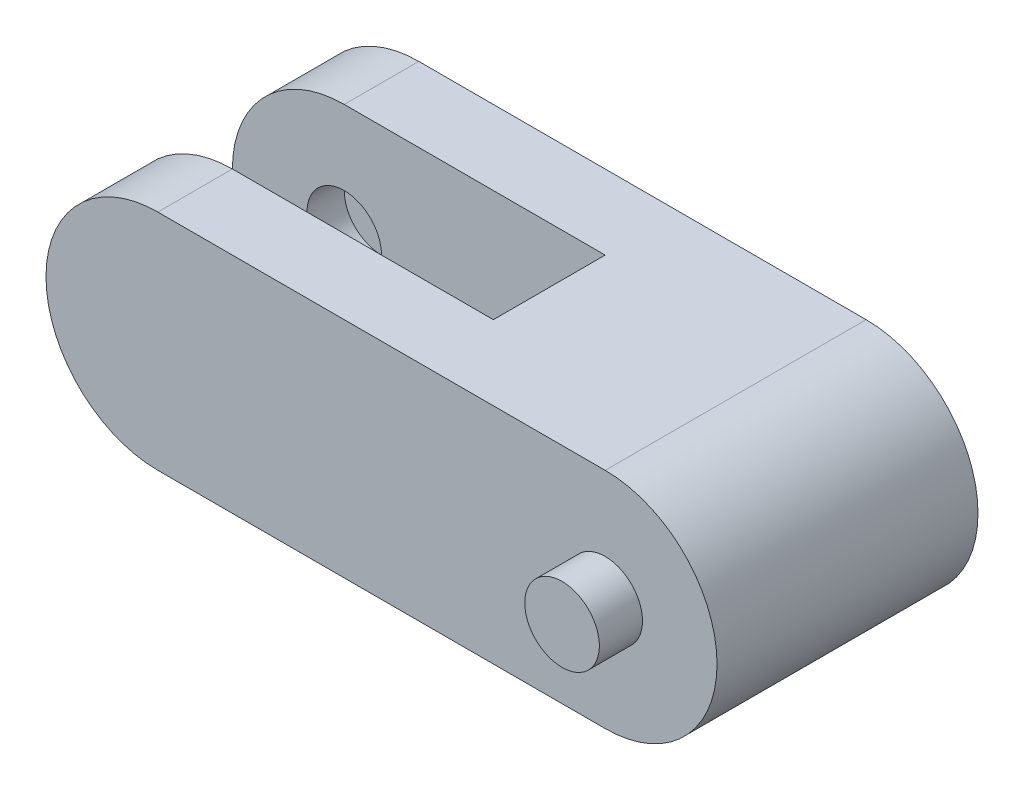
ISO-10303-21;
HEADER;
FILE_DESCRIPTION(('STEP AP214'),'2;1');
FILE_NAME('part.step','',(''),(''),'','','');
FILE_SCHEMA(('AUTOMOTIVE_DESIGN { 1 0 10303 214 1 1 1 1 }'));
ENDSEC;
DATA;
#1=APPLICATION_CONTEXT('core data for automotive mechanical design processes');
#2=APPLICATION_PROTOCOL_DEFINITION('international standard','automotive_design',2000,#1);
#3=PRODUCT_CONTEXT('',#1,'mechanical');
#4=PRODUCT('Part','Part','',(#3));
#5=PRODUCT_RELATED_PRODUCT_CATEGORY('part','',(#4));
#6=PRODUCT_DEFINITION_FORMATION('','',#4);
#7=PRODUCT_DEFINITION_CONTEXT('part definition',#1,'design');
#8=PRODUCT_DEFINITION('design','',#6,#7);
#9=PRODUCT_DEFINITION_SHAPE('','',#8);
#10=(LENGTH_UNIT() NAMED_UNIT(*) SI_UNIT(.MILLI.,.METRE.));
#11=(NAMED_UNIT(*) PLANE_ANGLE_UNIT() SI_UNIT($,.RADIAN.));
#12=(NAMED_UNIT(*) SI_UNIT($,.STERADIAN.) SOLID_ANGLE_UNIT());
#13=UNCERTAINTY_MEASURE_WITH_UNIT(LENGTH_MEASURE(1.E-05),#10,'distance_accuracy_value','');
#14=(GEOMETRIC_REPRESENTATION_CONTEXT(3) GLOBAL_UNCERTAINTY_ASSIGNED_CONTEXT((#13)) GLOBAL_UNIT_ASSIGNED_CONTEXT((#10,
#11,#12)) REPRESENTATION_CONTEXT('',''));
#15=CARTESIAN_POINT('',(0.,0.,0.));
#16=DIRECTION('',(0.,0.,1.));
#17=DIRECTION('',(1.,0.,0.));
#18=AXIS2_PLACEMENT_3D('',#15,#16,#17);
#19=CARTESIAN_POINT('',(-76.2,0.,44.45));
#20=DIRECTION('',(0.,0.,-1.));
#21=DIRECTION('',(-1.,0.,0.));
#22=AXIS2_PLACEMENT_3D('',#19,#20,#21);
#23=CYLINDRICAL_SURFACE('',#22,38.1);
#24=CARTESIAN_POINT('',(-76.1999999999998,0.,-19.05));
#25=DIRECTION('',(0.,0.,1.));
#26=DIRECTION('',(1.,0.,0.));
#27=AXIS2_PLACEMENT_3D('',#24,#25,#26);
#28=CIRCLE('',#27,38.1);
#29=CARTESIAN_POINT('',(-76.2,38.1,-19.05));
#30=VERTEX_POINT('',#29);
#31=CARTESIAN_POINT('',(-76.1999999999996,-38.1,-19.05));
#32=VERTEX_POINT('',#31);
#33=EDGE_CURVE('E117',#30,#32,#28,.T.);
#34=ORIENTED_EDGE('',*,*,#33,.F.);
#35=DIRECTION('',(0.,0.,-1.));
#36=VECTOR('',#35,1.);
#37=CARTESIAN_POINT('',(-76.2,38.1,44.45));
#38=LINE('',#37,#36);
#39=CARTESIAN_POINT('',(-76.2,38.1,-44.45));
#40=VERTEX_POINT('',#39);
#41=EDGE_CURVE('E87',#30,#40,#38,.T.);
#42=ORIENTED_EDGE('',*,*,#41,.T.);
#43=CARTESIAN_POINT('',(-76.2,0.,-44.45));
#44=DIRECTION('',(0.,0.,1.));
#45=DIRECTION('',(1.,0.,0.));
#46=AXIS2_PLACEMENT_3D('',#43,#44,#45);
#47=CIRCLE('',#46,38.1);
#48=CARTESIAN_POINT('',(-76.2,-38.1,-44.45));
#49=VERTEX_POINT('',#48);
#50=EDGE_CURVE('E136',#40,#49,#47,.T.);
#51=ORIENTED_EDGE('',*,*,#50,.T.);
#52=DIRECTION('',(0.,0.,-1.));
#53=VECTOR('',#52,1.);
#54=CARTESIAN_POINT('',(-76.2,-38.1,44.45));
#55=LINE('',#54,#53);
#56=EDGE_CURVE('E129',#32,#49,#55,.T.);
#57=ORIENTED_EDGE('',*,*,#56,.F.);
#58=EDGE_LOOP('',(#34,#42,#51,#57));
#59=FACE_BOUND('',#58,.T.);
#60=ADVANCED_FACE('F41',(#59),#23,.T.);
#61=CARTESIAN_POINT('',(-76.2,-38.1,44.45));
#62=DIRECTION('',(0.,1.,0.));
#63=DIRECTION('',(0.,0.,1.));
#64=AXIS2_PLACEMENT_3D('',#61,#62,#63);
#65=PLANE('',#64);
#66=DIRECTION('',(1.,0.,0.));
#67=VECTOR('',#66,1.);
#68=CARTESIAN_POINT('',(12.7,-38.1,-19.05));
#69=LINE('',#68,#67);
#70=CARTESIAN_POINT('',(12.7,-38.1,-19.05));
#71=VERTEX_POINT('',#70);
#72=EDGE_CURVE('E121',#32,#71,#69,.T.);
#73=ORIENTED_EDGE('',*,*,#72,.F.);
#74=ORIENTED_EDGE('',*,*,#56,.T.);
#75=DIRECTION('',(1.,0.,0.));
#76=VECTOR('',#75,1.);
#77=CARTESIAN_POINT('',(-76.2,-38.1,-44.45));
#78=LINE('',#77,#76);
#79=CARTESIAN_POINT('',(76.2,-38.1,-44.45));
#80=VERTEX_POINT('',#79);
#81=EDGE_CURVE('E157',#49,#80,#78,.T.);
#82=ORIENTED_EDGE('',*,*,#81,.T.);
#83=DIRECTION('',(0.,0.,-1.));
#84=VECTOR('',#83,1.);
#85=CARTESIAN_POINT('',(76.2,-38.1,44.45));
#86=LINE('',#85,#84);
#87=CARTESIAN_POINT('',(76.2,-38.1,44.45));
#88=VERTEX_POINT('',#87);
#89=EDGE_CURVE('E138',#88,#80,#86,.T.);
#90=ORIENTED_EDGE('',*,*,#89,.F.);
#91=DIRECTION('',(1.,0.,0.));
#92=VECTOR('',#91,1.);
#93=CARTESIAN_POINT('',(-76.2,-38.1,44.45));
#94=LINE('',#93,#92);
#95=CARTESIAN_POINT('',(-76.2,-38.1,44.45));
#96=VERTEX_POINT('',#95);
#97=EDGE_CURVE('E95',#96,#88,#94,.T.);
#98=ORIENTED_EDGE('',*,*,#97,.F.);
#99=CARTESIAN_POINT('',(-76.1999999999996,-38.1,19.05));
#100=VERTEX_POINT('',#99);
#101=EDGE_CURVE('E137',#96,#100,#55,.T.);
#102=ORIENTED_EDGE('',*,*,#101,.T.);
#103=DIRECTION('',(1.,0.,0.));
#104=VECTOR('',#103,1.);
#105=CARTESIAN_POINT('',(12.7,-38.1,19.05));
#106=LINE('',#105,#104);
#107=CARTESIAN_POINT('',(12.7,-38.1,19.05));
#108=VERTEX_POINT('',#107);
#109=EDGE_CURVE('E193',#100,#108,#106,.T.);
#110=ORIENTED_EDGE('',*,*,#109,.T.);
#111=DIRECTION('',(0.,0.,1.));
#112=VECTOR('',#111,1.);
#113=CARTESIAN_POINT('',(12.7,-38.1,-19.05));
#114=LINE('',#113,#112);
#115=EDGE_CURVE('E132',#71,#108,#114,.T.);
#116=ORIENTED_EDGE('',*,*,#115,.F.);
#117=EDGE_LOOP('',(#73,#74,#82,#90,#98,#102,#110,#116));
#118=FACE_BOUND('',#117,.T.);
#119=ADVANCED_FACE('F128',(#118),#65,.F.);
#120=CARTESIAN_POINT('',(-76.2,38.1,44.45));
#121=DIRECTION('',(0.,-1.,0.));
#122=DIRECTION('',(0.,0.,-1.));
#123=AXIS2_PLACEMENT_3D('',#120,#121,#122);
#124=PLANE('',#123);
#125=DIRECTION('',(-1.,0.,0.));
#126=VECTOR('',#125,1.);
#127=CARTESIAN_POINT('',(-76.2,38.1,-19.05));
#128=LINE('',#127,#126);
#129=CARTESIAN_POINT('',(12.7,38.1,-19.05));
#130=VERTEX_POINT('',#129);
#131=EDGE_CURVE('E124',#130,#30,#128,.T.);
#132=ORIENTED_EDGE('',*,*,#131,.F.);
#133=DIRECTION('',(0.,0.,1.));
#134=VECTOR('',#133,1.);
#135=CARTESIAN_POINT('',(12.7,38.1,-19.05));
#136=LINE('',#135,#134);
#137=CARTESIAN_POINT('',(12.7,38.1,19.05));
#138=VERTEX_POINT('',#137);
#139=EDGE_CURVE('E186',#130,#138,#136,.T.);
#140=ORIENTED_EDGE('',*,*,#139,.T.);
#141=DIRECTION('',(-1.,0.,0.));
#142=VECTOR('',#141,1.);
#143=CARTESIAN_POINT('',(-76.2,38.1,19.05));
#144=LINE('',#143,#142);
#145=CARTESIAN_POINT('',(-76.2,38.1,19.05));
#146=VERTEX_POINT('',#145);
#147=EDGE_CURVE('E126',#138,#146,#144,.T.);
#148=ORIENTED_EDGE('',*,*,#147,.T.);
#149=CARTESIAN_POINT('',(-76.2,38.1,44.45));
#150=VERTEX_POINT('',#149);
#151=EDGE_CURVE('E171',#150,#146,#38,.T.);
#152=ORIENTED_EDGE('',*,*,#151,.F.);
#153=DIRECTION('',(-1.,0.,0.));
#154=VECTOR('',#153,1.);
#155=CARTESIAN_POINT('',(-76.2,38.1,44.45));
#156=LINE('',#155,#154);
#157=CARTESIAN_POINT('',(76.2,38.1,44.45));
#158=VERTEX_POINT('',#157);
#159=EDGE_CURVE('E65',#158,#150,#156,.T.);
#160=ORIENTED_EDGE('',*,*,#159,.F.);
#161=DIRECTION('',(0.,0.,-1.));
#162=VECTOR('',#161,1.);
#163=CARTESIAN_POINT('',(76.2,38.1,44.45));
#164=LINE('',#163,#162);
#165=CARTESIAN_POINT('',(76.2,38.1,-44.45));
#166=VERTEX_POINT('',#165);
#167=EDGE_CURVE('E141',#158,#166,#164,.T.);
#168=ORIENTED_EDGE('',*,*,#167,.T.);
#169=DIRECTION('',(-1.,0.,0.));
#170=VECTOR('',#169,1.);
#171=CARTESIAN_POINT('',(-76.2,38.1,-44.45));
#172=LINE('',#171,#170);
#173=EDGE_CURVE('E156',#166,#40,#172,.T.);
#174=ORIENTED_EDGE('',*,*,#173,.T.);
#175=ORIENTED_EDGE('',*,*,#41,.F.);
#176=EDGE_LOOP('',(#132,#140,#148,#152,#160,#168,#174,#175));
#177=FACE_BOUND('',#176,.T.);
#178=ADVANCED_FACE('F176',(#177),#124,.F.);
#179=ORIENTED_EDGE('',*,*,#151,.T.);
#180=CARTESIAN_POINT('',(-76.1999999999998,0.,19.05));
#181=DIRECTION('',(0.,0.,1.));
#182=DIRECTION('',(1.,0.,0.));
#183=AXIS2_PLACEMENT_3D('',#180,#181,#182);
#184=CIRCLE('',#183,38.1);
#185=EDGE_CURVE('E56',#146,#100,#184,.T.);
#186=ORIENTED_EDGE('',*,*,#185,.T.);
#187=ORIENTED_EDGE('',*,*,#101,.F.);
#188=CARTESIAN_POINT('',(-76.2,0.,44.45));
#189=DIRECTION('',(0.,0.,1.));
#190=DIRECTION('',(1.,0.,0.));
#191=AXIS2_PLACEMENT_3D('',#188,#189,#190);
#192=CIRCLE('',#191,38.1);
#193=EDGE_CURVE('E170',#150,#96,#192,.T.);
#194=ORIENTED_EDGE('',*,*,#193,.F.);
#195=EDGE_LOOP('',(#179,#186,#187,#194));
#196=FACE_BOUND('',#195,.T.);
#197=ADVANCED_FACE('F43',(#196),#23,.T.);
#198=CARTESIAN_POINT('',(76.2,0.,44.45));
#199=DIRECTION('',(0.,0.,-1.));
#200=DIRECTION('',(-1.,0.,0.));
#201=AXIS2_PLACEMENT_3D('',#198,#199,#200);
#202=CYLINDRICAL_SURFACE('',#201,38.1);
#203=CARTESIAN_POINT('',(76.2,0.,-44.45));
#204=DIRECTION('',(0.,0.,1.));
#205=DIRECTION('',(-1.,0.,0.));
#206=AXIS2_PLACEMENT_3D('',#203,#204,#205);
#207=CIRCLE('',#206,38.1);
#208=EDGE_CURVE('E160',#80,#166,#207,.T.);
#209=ORIENTED_EDGE('',*,*,#208,.T.);
#210=ORIENTED_EDGE('',*,*,#167,.F.);
#211=CARTESIAN_POINT('',(76.2,0.,44.45));
#212=DIRECTION('',(0.,0.,1.));
#213=DIRECTION('',(-1.,0.,0.));
#214=AXIS2_PLACEMENT_3D('',#211,#212,#213);
#215=CIRCLE('',#214,38.1);
#216=EDGE_CURVE('E180',#88,#158,#215,.T.);
#217=ORIENTED_EDGE('',*,*,#216,.F.);
#218=ORIENTED_EDGE('',*,*,#89,.T.);
#219=EDGE_LOOP('',(#209,#210,#217,#218));
#220=FACE_BOUND('',#219,.T.);
#221=ADVANCED_FACE('F179',(#220),#202,.T.);
#222=CARTESIAN_POINT('',(-76.2,0.,44.45));
#223=DIRECTION('',(0.,0.,1.));
#224=DIRECTION('',(1.,0.,0.));
#225=AXIS2_PLACEMENT_3D('',#222,#223,#224);
#226=PLANE('',#225);
#227=CARTESIAN_POINT('',(76.2,0.,44.45));
#228=DIRECTION('',(0.,0.,1.));
#229=DIRECTION('',(1.,0.,0.));
#230=AXIS2_PLACEMENT_3D('',#227,#228,#229);
#231=CIRCLE('',#230,12.7);
#232=CARTESIAN_POINT('',(88.9,0.,44.45));
#233=VERTEX_POINT('',#232);
#234=EDGE_CURVE('E11',#233,#233,#231,.T.);
#235=ORIENTED_EDGE('',*,*,#234,.F.);
#236=EDGE_LOOP('',(#235));
#237=FACE_BOUND('',#236,.T.);
#238=ORIENTED_EDGE('',*,*,#193,.T.);
#239=ORIENTED_EDGE('',*,*,#97,.T.);
#240=ORIENTED_EDGE('',*,*,#216,.T.);
#241=ORIENTED_EDGE('',*,*,#159,.T.);
#242=EDGE_LOOP('',(#238,#239,#240,#241));
#243=FACE_BOUND('',#242,.T.);
#244=ADVANCED_FACE('F152',(#237,#243),#226,.T.);
#245=CARTESIAN_POINT('',(-76.2,0.,-44.45));
#246=DIRECTION('',(0.,0.,1.));
#247=DIRECTION('',(1.,0.,0.));
#248=AXIS2_PLACEMENT_3D('',#245,#246,#247);
#249=PLANE('',#248);
#250=CARTESIAN_POINT('',(76.2,0.,-44.45));
#251=DIRECTION('',(0.,0.,1.));
#252=DIRECTION('',(1.,0.,0.));
#253=AXIS2_PLACEMENT_3D('',#250,#251,#252);
#254=CIRCLE('',#253,12.7);
#255=CARTESIAN_POINT('',(88.9,0.,-44.45));
#256=VERTEX_POINT('',#255);
#257=EDGE_CURVE('E49',#256,#256,#254,.F.);
#258=ORIENTED_EDGE('',*,*,#257,.F.);
#259=EDGE_LOOP('',(#258));
#260=FACE_BOUND('',#259,.T.);
#261=ORIENTED_EDGE('',*,*,#50,.F.);
#262=ORIENTED_EDGE('',*,*,#173,.F.);
#263=ORIENTED_EDGE('',*,*,#208,.F.);
#264=ORIENTED_EDGE('',*,*,#81,.F.);
#265=EDGE_LOOP('',(#261,#262,#263,#264));
#266=FACE_BOUND('',#265,.T.);
#267=ADVANCED_FACE('F149',(#260,#266),#249,.F.);
#268=CARTESIAN_POINT('',(76.2,0.,-59.15));
#269=DIRECTION('',(0.,0.,1.));
#270=DIRECTION('',(1.,0.,0.));
#271=AXIS2_PLACEMENT_3D('',#268,#269,#270);
#272=CYLINDRICAL_SURFACE('',#271,12.7);
#273=CARTESIAN_POINT('',(76.2,0.,-59.15));
#274=DIRECTION('',(0.,0.,-1.));
#275=DIRECTION('',(-1.,0.,0.));
#276=AXIS2_PLACEMENT_3D('',#273,#274,#275);
#277=CIRCLE('',#276,12.7);
#278=CARTESIAN_POINT('',(63.5,0.,-59.15));
#279=VERTEX_POINT('',#278);
#280=EDGE_CURVE('E158',#279,#279,#277,.T.);
#281=ORIENTED_EDGE('',*,*,#280,.F.);
#282=EDGE_LOOP('',(#281));
#283=FACE_BOUND('',#282,.T.);
#284=ORIENTED_EDGE('',*,*,#257,.T.);
#285=EDGE_LOOP('',(#284));
#286=FACE_BOUND('',#285,.T.);
#287=ADVANCED_FACE('F147',(#283,#286),#272,.T.);
#288=CARTESIAN_POINT('',(76.2,0.,-59.15));
#289=DIRECTION('',(0.,0.,-1.));
#290=DIRECTION('',(-1.,0.,0.));
#291=AXIS2_PLACEMENT_3D('',#288,#289,#290);
#292=PLANE('',#291);
#293=ORIENTED_EDGE('',*,*,#280,.T.);
#294=EDGE_LOOP('',(#293));
#295=FACE_BOUND('',#294,.T.);
#296=ADVANCED_FACE('F256',(#295),#292,.T.);
#297=CARTESIAN_POINT('',(76.2,0.,59.15));
#298=DIRECTION('',(0.,0.,-1.));
#299=DIRECTION('',(-1.,0.,0.));
#300=AXIS2_PLACEMENT_3D('',#297,#298,#299);
#301=CYLINDRICAL_SURFACE('',#300,12.7);
#302=CARTESIAN_POINT('',(76.2,0.,59.15));
#303=DIRECTION('',(0.,0.,-1.));
#304=DIRECTION('',(-1.,0.,0.));
#305=AXIS2_PLACEMENT_3D('',#302,#303,#304);
#306=CIRCLE('',#305,12.7);
#307=CARTESIAN_POINT('',(63.5,0.,59.15));
#308=VERTEX_POINT('',#307);
#309=EDGE_CURVE('E163',#308,#308,#306,.T.);
#310=ORIENTED_EDGE('',*,*,#309,.T.);
#311=EDGE_LOOP('',(#310));
#312=FACE_BOUND('',#311,.T.);
#313=ORIENTED_EDGE('',*,*,#234,.T.);
#314=EDGE_LOOP('',(#313));
#315=FACE_BOUND('',#314,.T.);
#316=ADVANCED_FACE('F249',(#312,#315),#301,.T.);
#317=CARTESIAN_POINT('',(76.2,0.,59.15));
#318=DIRECTION('',(0.,0.,1.));
#319=DIRECTION('',(-1.,0.,0.));
#320=AXIS2_PLACEMENT_3D('',#317,#318,#319);
#321=PLANE('',#320);
#322=ORIENTED_EDGE('',*,*,#309,.F.);
#323=EDGE_LOOP('',(#322));
#324=FACE_BOUND('',#323,.T.);
#325=ADVANCED_FACE('F242',(#324),#321,.T.);
#326=CARTESIAN_POINT('',(12.7,38.1,-19.05));
#327=DIRECTION('',(1.,0.,0.));
#328=DIRECTION('',(0.,1.,0.));
#329=AXIS2_PLACEMENT_3D('',#326,#327,#328);
#330=PLANE('',#329);
#331=DIRECTION('',(0.,1.,0.));
#332=VECTOR('',#331,1.);
#333=CARTESIAN_POINT('',(12.7,38.1,19.05));
#334=LINE('',#333,#332);
#335=EDGE_CURVE('E191',#108,#138,#334,.T.);
#336=ORIENTED_EDGE('',*,*,#335,.T.);
#337=ORIENTED_EDGE('',*,*,#139,.F.);
#338=DIRECTION('',(0.,1.,0.));
#339=VECTOR('',#338,1.);
#340=CARTESIAN_POINT('',(12.7,38.1,-19.05));
#341=LINE('',#340,#339);
#342=EDGE_CURVE('E133',#71,#130,#341,.T.);
#343=ORIENTED_EDGE('',*,*,#342,.F.);
#344=ORIENTED_EDGE('',*,*,#115,.T.);
#345=EDGE_LOOP('',(#336,#337,#343,#344));
#346=FACE_BOUND('',#345,.T.);
#347=ADVANCED_FACE('F241',(#346),#330,.F.);
#348=CARTESIAN_POINT('',(-76.1999999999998,0.,-19.05));
#349=DIRECTION('',(0.,0.,1.));
#350=DIRECTION('',(1.,0.,0.));
#351=AXIS2_PLACEMENT_3D('',#348,#349,#350);
#352=PLANE('',#351);
#353=CARTESIAN_POINT('',(-76.2,0.,-19.05));
#354=DIRECTION('',(0.,0.,1.));
#355=DIRECTION('',(1.,0.,0.));
#356=AXIS2_PLACEMENT_3D('',#353,#354,#355);
#357=CIRCLE('',#356,12.7);
#358=CARTESIAN_POINT('',(-63.5,0.,-19.05));
#359=VERTEX_POINT('',#358);
#360=EDGE_CURVE('E199',#359,#359,#357,.T.);
#361=ORIENTED_EDGE('',*,*,#360,.F.);
#362=EDGE_LOOP('',(#361));
#363=FACE_BOUND('',#362,.T.);
#364=ORIENTED_EDGE('',*,*,#33,.T.);
#365=ORIENTED_EDGE('',*,*,#72,.T.);
#366=ORIENTED_EDGE('',*,*,#342,.T.);
#367=ORIENTED_EDGE('',*,*,#131,.T.);
#368=EDGE_LOOP('',(#364,#365,#366,#367));
#369=FACE_BOUND('',#368,.T.);
#370=ADVANCED_FACE('F119',(#363,#369),#352,.T.);
#371=CARTESIAN_POINT('',(-76.1999999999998,0.,19.05));
#372=DIRECTION('',(0.,0.,1.));
#373=DIRECTION('',(1.,0.,0.));
#374=AXIS2_PLACEMENT_3D('',#371,#372,#373);
#375=PLANE('',#374);
#376=CARTESIAN_POINT('',(-76.2,0.,19.05));
#377=DIRECTION('',(0.,0.,1.));
#378=DIRECTION('',(1.,0.,0.));
#379=AXIS2_PLACEMENT_3D('',#376,#377,#378);
#380=CIRCLE('',#379,12.7);
#381=CARTESIAN_POINT('',(-63.5,0.,19.05));
#382=VERTEX_POINT('',#381);
#383=EDGE_CURVE('E205',#382,#382,#380,.T.);
#384=ORIENTED_EDGE('',*,*,#383,.T.);
#385=EDGE_LOOP('',(#384));
#386=FACE_BOUND('',#385,.T.);
#387=ORIENTED_EDGE('',*,*,#185,.F.);
#388=ORIENTED_EDGE('',*,*,#147,.F.);
#389=ORIENTED_EDGE('',*,*,#335,.F.);
#390=ORIENTED_EDGE('',*,*,#109,.F.);
#391=EDGE_LOOP('',(#387,#388,#389,#390));
#392=FACE_BOUND('',#391,.T.);
#393=ADVANCED_FACE('F239',(#386,#392),#375,.F.);
#394=CARTESIAN_POINT('',(-76.2,0.,-31.75));
#395=DIRECTION('',(0.,0.,1.));
#396=DIRECTION('',(1.,0.,0.));
#397=AXIS2_PLACEMENT_3D('',#394,#395,#396);
#398=CYLINDRICAL_SURFACE('',#397,12.7);
#399=CARTESIAN_POINT('',(-76.2,0.,-31.75));
#400=DIRECTION('',(0.,0.,1.));
#401=DIRECTION('',(1.,0.,0.));
#402=AXIS2_PLACEMENT_3D('',#399,#400,#401);
#403=CIRCLE('',#402,12.7);
#404=CARTESIAN_POINT('',(-63.5,0.,-31.75));
#405=VERTEX_POINT('',#404);
#406=EDGE_CURVE('E196',#405,#405,#403,.T.);
#407=ORIENTED_EDGE('',*,*,#406,.F.);
#408=EDGE_LOOP('',(#407));
#409=FACE_BOUND('',#408,.T.);
#410=ORIENTED_EDGE('',*,*,#360,.T.);
#411=EDGE_LOOP('',(#410));
#412=FACE_BOUND('',#411,.T.);
#413=ADVANCED_FACE('F319',(#409,#412),#398,.F.);
#414=CARTESIAN_POINT('',(-76.2,0.,-31.75));
#415=DIRECTION('',(0.,0.,1.));
#416=DIRECTION('',(1.,0.,0.));
#417=AXIS2_PLACEMENT_3D('',#414,#415,#416);
#418=PLANE('',#417);
#419=ORIENTED_EDGE('',*,*,#406,.T.);
#420=EDGE_LOOP('',(#419));
#421=FACE_BOUND('',#420,.T.);
#422=ADVANCED_FACE('F220',(#421),#418,.T.);
#423=CARTESIAN_POINT('',(-76.2,0.,31.75));
#424=DIRECTION('',(0.,0.,-1.));
#425=DIRECTION('',(-1.,0.,0.));
#426=AXIS2_PLACEMENT_3D('',#423,#424,#425);
#427=CYLINDRICAL_SURFACE('',#426,12.7);
#428=CARTESIAN_POINT('',(-76.2,0.,31.75));
#429=DIRECTION('',(0.,0.,1.));
#430=DIRECTION('',(1.,0.,0.));
#431=AXIS2_PLACEMENT_3D('',#428,#429,#430);
#432=CIRCLE('',#431,12.7);
#433=CARTESIAN_POINT('',(-63.5,0.,31.75));
#434=VERTEX_POINT('',#433);
#435=EDGE_CURVE('E202',#434,#434,#432,.T.);
#436=ORIENTED_EDGE('',*,*,#435,.T.);
#437=EDGE_LOOP('',(#436));
#438=FACE_BOUND('',#437,.T.);
#439=ORIENTED_EDGE('',*,*,#383,.F.);
#440=EDGE_LOOP('',(#439));
#441=FACE_BOUND('',#440,.T.);
#442=ADVANCED_FACE('F211',(#438,#441),#427,.F.);
#443=CARTESIAN_POINT('',(-76.2,0.,31.75));
#444=DIRECTION('',(0.,0.,-1.));
#445=DIRECTION('',(1.,0.,0.));
#446=AXIS2_PLACEMENT_3D('',#443,#444,#445);
#447=PLANE('',#446);
#448=ORIENTED_EDGE('',*,*,#435,.F.);
#449=EDGE_LOOP('',(#448));
#450=FACE_BOUND('',#449,.T.);
#451=ADVANCED_FACE('F214',(#450),#447,.T.);
#452=CLOSED_SHELL('',(#60,#119,#178,#197,#221,#244,#267,#287,#296,#316,#325,#347,#370,#393,#413,
#422,#442,#451));
#453=MANIFOLD_SOLID_BREP('B2',#452);
#454=ADVANCED_BREP_SHAPE_REPRESENTATION('',(#18,#453),#14);
#455=SHAPE_DEFINITION_REPRESENTATION(#9,#454);
ENDSEC;
END-ISO-10303-21;
